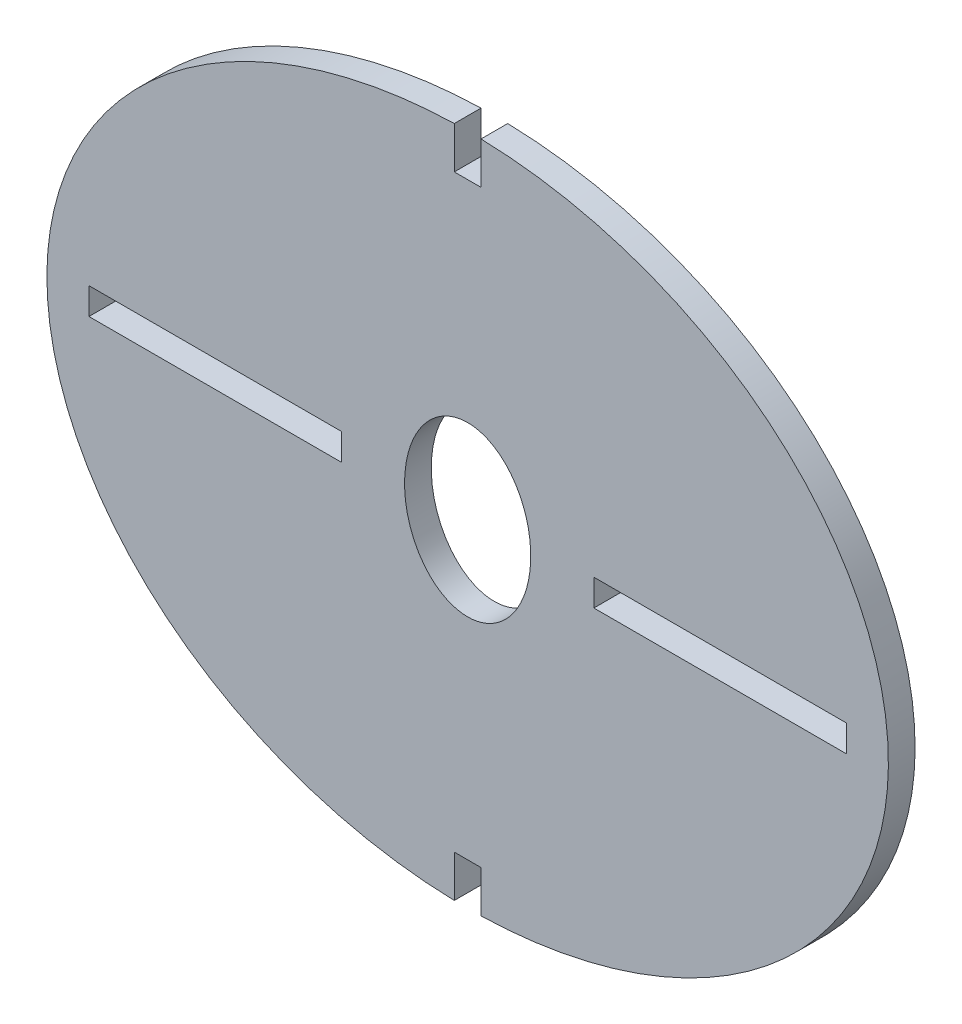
ISO-10303-21;
HEADER;
FILE_DESCRIPTION(('STEP AP214'),'2;1');
FILE_NAME('part.step','',(''),(''),'','','');
FILE_SCHEMA(('AUTOMOTIVE_DESIGN { 1 0 10303 214 1 1 1 1 }'));
ENDSEC;
DATA;
#1=APPLICATION_CONTEXT('core data for automotive mechanical design processes');
#2=APPLICATION_PROTOCOL_DEFINITION('international standard','automotive_design',2000,#1);
#3=PRODUCT_CONTEXT('',#1,'mechanical');
#4=PRODUCT('Part','Part','',(#3));
#5=PRODUCT_RELATED_PRODUCT_CATEGORY('part','',(#4));
#6=PRODUCT_DEFINITION_FORMATION('','',#4);
#7=PRODUCT_DEFINITION_CONTEXT('part definition',#1,'design');
#8=PRODUCT_DEFINITION('design','',#6,#7);
#9=PRODUCT_DEFINITION_SHAPE('','',#8);
#10=(LENGTH_UNIT() NAMED_UNIT(*) SI_UNIT(.MILLI.,.METRE.));
#11=(NAMED_UNIT(*) PLANE_ANGLE_UNIT() SI_UNIT($,.RADIAN.));
#12=(NAMED_UNIT(*) SI_UNIT($,.STERADIAN.) SOLID_ANGLE_UNIT());
#13=UNCERTAINTY_MEASURE_WITH_UNIT(LENGTH_MEASURE(1.E-05),#10,'distance_accuracy_value','');
#14=(GEOMETRIC_REPRESENTATION_CONTEXT(3) GLOBAL_UNCERTAINTY_ASSIGNED_CONTEXT((#13)) GLOBAL_UNIT_ASSIGNED_CONTEXT((#10,
#11,#12)) REPRESENTATION_CONTEXT('',''));
#15=CARTESIAN_POINT('',(0.,0.,0.));
#16=DIRECTION('',(0.,0.,1.));
#17=DIRECTION('',(1.,0.,0.));
#18=AXIS2_PLACEMENT_3D('',#15,#16,#17);
#19=CARTESIAN_POINT('',(0.,0.,3.175));
#20=DIRECTION('',(0.,0.,1.));
#21=DIRECTION('',(-1.,0.,0.));
#22=AXIS2_PLACEMENT_3D('',#19,#20,#21);
#23=ELLIPSE('',#22,50.,40.);
#24=DIRECTION('',(0.,0.,-1.));
#25=VECTOR('',#24,1.);
#26=SURFACE_OF_LINEAR_EXTRUSION('',#23,#25);
#27=CARTESIAN_POINT('',(0.,0.,0.));
#28=DIRECTION('',(0.,0.,1.));
#29=DIRECTION('',(-1.,0.,0.));
#30=AXIS2_PLACEMENT_3D('',#27,#28,#29);
#31=ELLIPSE('',#30,50.,40.);
#32=CARTESIAN_POINT('',(-1.58750000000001,39.9798336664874,0.));
#33=VERTEX_POINT('',#32);
#34=CARTESIAN_POINT('',(-1.58749999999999,-39.9798336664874,0.));
#35=VERTEX_POINT('',#34);
#36=EDGE_CURVE('E285',#33,#35,#31,.T.);
#37=ORIENTED_EDGE('',*,*,#36,.T.);
#38=DIRECTION('',(0.,0.,-1.));
#39=VECTOR('',#38,1.);
#40=CARTESIAN_POINT('',(-1.58749999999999,-39.9798336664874,3.175));
#41=LINE('',#40,#39);
#42=CARTESIAN_POINT('',(-1.58749999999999,-39.9798336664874,3.175));
#43=VERTEX_POINT('',#42);
#44=EDGE_CURVE('E41',#35,#43,#41,.F.);
#45=ORIENTED_EDGE('',*,*,#44,.T.);
#46=CARTESIAN_POINT('',(-1.5875,39.9798336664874,3.175));
#47=VERTEX_POINT('',#46);
#48=EDGE_CURVE('E289',#47,#43,#23,.T.);
#49=ORIENTED_EDGE('',*,*,#48,.F.);
#50=DIRECTION('',(0.,0.,-1.));
#51=VECTOR('',#50,1.);
#52=CARTESIAN_POINT('',(-1.5875,39.9798336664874,3.175));
#53=LINE('',#52,#51);
#54=EDGE_CURVE('E287',#47,#33,#53,.T.);
#55=ORIENTED_EDGE('',*,*,#54,.T.);
#56=EDGE_LOOP('',(#37,#45,#49,#55));
#57=FACE_BOUND('',#56,.T.);
#58=ADVANCED_FACE('F32',(#57),#26,.F.);
#59=CARTESIAN_POINT('',(0.,0.,3.175));
#60=DIRECTION('',(0.,0.,1.));
#61=DIRECTION('',(1.,0.,0.));
#62=AXIS2_PLACEMENT_3D('',#59,#60,#61);
#63=PLANE('',#62);
#64=DIRECTION('',(0.,-1.,0.));
#65=VECTOR('',#64,1.);
#66=CARTESIAN_POINT('',(-1.58749999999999,-35.,3.175));
#67=LINE('',#66,#65);
#68=CARTESIAN_POINT('',(-1.58749999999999,-35.,3.175));
#69=VERTEX_POINT('',#68);
#70=EDGE_CURVE('E160',#69,#43,#67,.T.);
#71=ORIENTED_EDGE('',*,*,#70,.F.);
#72=DIRECTION('',(-1.,0.,0.));
#73=VECTOR('',#72,1.);
#74=CARTESIAN_POINT('',(0.,-35.,3.175));
#75=LINE('',#74,#73);
#76=CARTESIAN_POINT('',(1.58750000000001,-35.,3.175));
#77=VERTEX_POINT('',#76);
#78=EDGE_CURVE('E153',#77,#69,#75,.T.);
#79=ORIENTED_EDGE('',*,*,#78,.F.);
#80=DIRECTION('',(0.,1.,0.));
#81=VECTOR('',#80,1.);
#82=CARTESIAN_POINT('',(1.58750000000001,-61.3968723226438,3.175));
#83=LINE('',#82,#81);
#84=CARTESIAN_POINT('',(1.58750000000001,-39.9798336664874,3.175));
#85=VERTEX_POINT('',#84);
#86=EDGE_CURVE('E157',#85,#77,#83,.T.);
#87=ORIENTED_EDGE('',*,*,#86,.F.);
#88=CARTESIAN_POINT('',(1.58750000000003,39.9798336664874,3.175));
#89=VERTEX_POINT('',#88);
#90=EDGE_CURVE('E56',#85,#89,#23,.T.);
#91=ORIENTED_EDGE('',*,*,#90,.T.);
#92=DIRECTION('',(0.,1.,0.));
#93=VECTOR('',#92,1.);
#94=CARTESIAN_POINT('',(1.5875,61.3968723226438,3.175));
#95=LINE('',#94,#93);
#96=CARTESIAN_POINT('',(1.5875,35.,3.175));
#97=VERTEX_POINT('',#96);
#98=EDGE_CURVE('E173',#97,#89,#95,.T.);
#99=ORIENTED_EDGE('',*,*,#98,.F.);
#100=DIRECTION('',(1.,0.,0.));
#101=VECTOR('',#100,1.);
#102=CARTESIAN_POINT('',(0.,35.,3.175));
#103=LINE('',#102,#101);
#104=CARTESIAN_POINT('',(-1.5875,35.,3.175));
#105=VERTEX_POINT('',#104);
#106=EDGE_CURVE('E178',#105,#97,#103,.T.);
#107=ORIENTED_EDGE('',*,*,#106,.F.);
#108=DIRECTION('',(0.,-1.,0.));
#109=VECTOR('',#108,1.);
#110=CARTESIAN_POINT('',(-1.5875,35.,3.175));
#111=LINE('',#110,#109);
#112=EDGE_CURVE('E175',#47,#105,#111,.T.);
#113=ORIENTED_EDGE('',*,*,#112,.F.);
#114=ORIENTED_EDGE('',*,*,#48,.T.);
#115=EDGE_LOOP('',(#71,#79,#87,#91,#99,#107,#113,#114));
#116=FACE_BOUND('',#115,.T.);
#117=CARTESIAN_POINT('',(0.,0.,3.175));
#118=DIRECTION('',(0.,0.,1.));
#119=DIRECTION('',(0.,-1.,0.));
#120=AXIS2_PLACEMENT_3D('',#117,#118,#119);
#121=ELLIPSE('',#120,10.,7.5);
#122=CARTESIAN_POINT('',(0.,-10.,3.175));
#123=VERTEX_POINT('',#122);
#124=EDGE_CURVE('E254',#123,#123,#121,.T.);
#125=ORIENTED_EDGE('',*,*,#124,.F.);
#126=EDGE_LOOP('',(#125));
#127=FACE_BOUND('',#126,.T.);
#128=DIRECTION('',(1.,0.,0.));
#129=VECTOR('',#128,1.);
#130=CARTESIAN_POINT('',(-45.,-1.58750000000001,3.175));
#131=LINE('',#130,#129);
#132=CARTESIAN_POINT('',(-45.,-1.58750000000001,3.175));
#133=VERTEX_POINT('',#132);
#134=CARTESIAN_POINT('',(-15.,-1.58750000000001,3.175));
#135=VERTEX_POINT('',#134);
#136=EDGE_CURVE('E225',#133,#135,#131,.T.);
#137=ORIENTED_EDGE('',*,*,#136,.F.);
#138=DIRECTION('',(0.,-1.,0.));
#139=VECTOR('',#138,1.);
#140=CARTESIAN_POINT('',(-45.,1.58749999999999,3.175));
#141=LINE('',#140,#139);
#142=CARTESIAN_POINT('',(-45.,1.58749999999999,3.175));
#143=VERTEX_POINT('',#142);
#144=EDGE_CURVE('E223',#143,#133,#141,.T.);
#145=ORIENTED_EDGE('',*,*,#144,.F.);
#146=DIRECTION('',(-1.,0.,0.));
#147=VECTOR('',#146,1.);
#148=CARTESIAN_POINT('',(-15.,1.5875,3.175));
#149=LINE('',#148,#147);
#150=CARTESIAN_POINT('',(-15.,1.5875,3.175));
#151=VERTEX_POINT('',#150);
#152=EDGE_CURVE('E231',#151,#143,#149,.T.);
#153=ORIENTED_EDGE('',*,*,#152,.F.);
#154=DIRECTION('',(0.,1.,0.));
#155=VECTOR('',#154,1.);
#156=CARTESIAN_POINT('',(-15.,1.5875,3.175));
#157=LINE('',#156,#155);
#158=EDGE_CURVE('E228',#135,#151,#157,.T.);
#159=ORIENTED_EDGE('',*,*,#158,.F.);
#160=EDGE_LOOP('',(#137,#145,#153,#159));
#161=FACE_BOUND('',#160,.T.);
#162=DIRECTION('',(0.,-1.,0.));
#163=VECTOR('',#162,1.);
#164=CARTESIAN_POINT('',(15.,1.5875,3.175));
#165=LINE('',#164,#163);
#166=CARTESIAN_POINT('',(15.,1.5875,3.175));
#167=VERTEX_POINT('',#166);
#168=CARTESIAN_POINT('',(15.,-1.5875,3.175));
#169=VERTEX_POINT('',#168);
#170=EDGE_CURVE('E194',#167,#169,#165,.T.);
#171=ORIENTED_EDGE('',*,*,#170,.F.);
#172=DIRECTION('',(-1.,0.,0.));
#173=VECTOR('',#172,1.);
#174=CARTESIAN_POINT('',(15.,1.5875,3.175));
#175=LINE('',#174,#173);
#176=CARTESIAN_POINT('',(45.,1.58750000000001,3.175));
#177=VERTEX_POINT('',#176);
#178=EDGE_CURVE('E192',#177,#167,#175,.T.);
#179=ORIENTED_EDGE('',*,*,#178,.F.);
#180=DIRECTION('',(0.,1.,0.));
#181=VECTOR('',#180,1.);
#182=CARTESIAN_POINT('',(45.,1.58750000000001,3.175));
#183=LINE('',#182,#181);
#184=CARTESIAN_POINT('',(45.,-1.58749999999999,3.175));
#185=VERTEX_POINT('',#184);
#186=EDGE_CURVE('E200',#185,#177,#183,.T.);
#187=ORIENTED_EDGE('',*,*,#186,.F.);
#188=DIRECTION('',(1.,0.,0.));
#189=VECTOR('',#188,1.);
#190=CARTESIAN_POINT('',(45.,-1.58749999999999,3.175));
#191=LINE('',#190,#189);
#192=EDGE_CURVE('E197',#169,#185,#191,.T.);
#193=ORIENTED_EDGE('',*,*,#192,.F.);
#194=EDGE_LOOP('',(#171,#179,#187,#193));
#195=FACE_BOUND('',#194,.T.);
#196=ADVANCED_FACE('F162',(#116,#127,#161,#195),#63,.T.);
#197=CARTESIAN_POINT('',(0.,0.,0.));
#198=DIRECTION('',(0.,0.,1.));
#199=DIRECTION('',(1.,0.,0.));
#200=AXIS2_PLACEMENT_3D('',#197,#198,#199);
#201=PLANE('',#200);
#202=DIRECTION('',(0.,-1.,0.));
#203=VECTOR('',#202,1.);
#204=CARTESIAN_POINT('',(-45.,1.58749999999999,0.));
#205=LINE('',#204,#203);
#206=CARTESIAN_POINT('',(-45.,1.58749999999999,0.));
#207=VERTEX_POINT('',#206);
#208=CARTESIAN_POINT('',(-45.,-1.58750000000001,0.));
#209=VERTEX_POINT('',#208);
#210=EDGE_CURVE('E222',#207,#209,#205,.T.);
#211=ORIENTED_EDGE('',*,*,#210,.T.);
#212=DIRECTION('',(1.,0.,0.));
#213=VECTOR('',#212,1.);
#214=CARTESIAN_POINT('',(-45.,-1.58750000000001,0.));
#215=LINE('',#214,#213);
#216=CARTESIAN_POINT('',(-15.,-1.58750000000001,0.));
#217=VERTEX_POINT('',#216);
#218=EDGE_CURVE('E236',#209,#217,#215,.T.);
#219=ORIENTED_EDGE('',*,*,#218,.T.);
#220=DIRECTION('',(0.,1.,0.));
#221=VECTOR('',#220,1.);
#222=CARTESIAN_POINT('',(-15.,1.5875,0.));
#223=LINE('',#222,#221);
#224=CARTESIAN_POINT('',(-15.,1.5875,0.));
#225=VERTEX_POINT('',#224);
#226=EDGE_CURVE('E239',#217,#225,#223,.T.);
#227=ORIENTED_EDGE('',*,*,#226,.T.);
#228=DIRECTION('',(-1.,0.,0.));
#229=VECTOR('',#228,1.);
#230=CARTESIAN_POINT('',(-15.,1.5875,0.));
#231=LINE('',#230,#229);
#232=EDGE_CURVE('E226',#225,#207,#231,.T.);
#233=ORIENTED_EDGE('',*,*,#232,.T.);
#234=EDGE_LOOP('',(#211,#219,#227,#233));
#235=FACE_BOUND('',#234,.T.);
#236=DIRECTION('',(-1.,0.,0.));
#237=VECTOR('',#236,1.);
#238=CARTESIAN_POINT('',(0.,-35.,0.));
#239=LINE('',#238,#237);
#240=CARTESIAN_POINT('',(1.58750000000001,-35.,0.));
#241=VERTEX_POINT('',#240);
#242=CARTESIAN_POINT('',(-1.58749999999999,-35.,0.));
#243=VERTEX_POINT('',#242);
#244=EDGE_CURVE('E11',#241,#243,#239,.T.);
#245=ORIENTED_EDGE('',*,*,#244,.T.);
#246=DIRECTION('',(0.,-1.,0.));
#247=VECTOR('',#246,1.);
#248=CARTESIAN_POINT('',(-1.5875,0.,0.));
#249=LINE('',#248,#247);
#250=EDGE_CURVE('E170',#243,#35,#249,.T.);
#251=ORIENTED_EDGE('',*,*,#250,.T.);
#252=ORIENTED_EDGE('',*,*,#36,.F.);
#253=DIRECTION('',(0.,-1.,0.));
#254=VECTOR('',#253,1.);
#255=CARTESIAN_POINT('',(-1.5875,0.,0.));
#256=LINE('',#255,#254);
#257=CARTESIAN_POINT('',(-1.5875,35.,0.));
#258=VERTEX_POINT('',#257);
#259=EDGE_CURVE('E188',#33,#258,#256,.T.);
#260=ORIENTED_EDGE('',*,*,#259,.T.);
#261=DIRECTION('',(1.,0.,0.));
#262=VECTOR('',#261,1.);
#263=CARTESIAN_POINT('',(0.,35.,0.));
#264=LINE('',#263,#262);
#265=CARTESIAN_POINT('',(1.5875,35.,0.));
#266=VERTEX_POINT('',#265);
#267=EDGE_CURVE('E296',#258,#266,#264,.T.);
#268=ORIENTED_EDGE('',*,*,#267,.T.);
#269=DIRECTION('',(0.,1.,0.));
#270=VECTOR('',#269,1.);
#271=CARTESIAN_POINT('',(1.5875,0.,0.));
#272=LINE('',#271,#270);
#273=CARTESIAN_POINT('',(1.58750000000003,39.9798336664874,0.));
#274=VERTEX_POINT('',#273);
#275=EDGE_CURVE('E184',#266,#274,#272,.T.);
#276=ORIENTED_EDGE('',*,*,#275,.T.);
#277=CARTESIAN_POINT('',(1.5875,-39.9798336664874,0.));
#278=VERTEX_POINT('',#277);
#279=EDGE_CURVE('E258',#278,#274,#31,.T.);
#280=ORIENTED_EDGE('',*,*,#279,.F.);
#281=DIRECTION('',(0.,1.,0.));
#282=VECTOR('',#281,1.);
#283=CARTESIAN_POINT('',(1.5875,0.,0.));
#284=LINE('',#283,#282);
#285=EDGE_CURVE('E48',#278,#241,#284,.T.);
#286=ORIENTED_EDGE('',*,*,#285,.T.);
#287=EDGE_LOOP('',(#245,#251,#252,#260,#268,#276,#280,#286));
#288=FACE_BOUND('',#287,.T.);
#289=CARTESIAN_POINT('',(0.,0.,0.));
#290=DIRECTION('',(0.,0.,1.));
#291=DIRECTION('',(0.,-1.,0.));
#292=AXIS2_PLACEMENT_3D('',#289,#290,#291);
#293=ELLIPSE('',#292,10.,7.5);
#294=CARTESIAN_POINT('',(0.,-10.,0.));
#295=VERTEX_POINT('',#294);
#296=EDGE_CURVE('E253',#295,#295,#293,.T.);
#297=ORIENTED_EDGE('',*,*,#296,.T.);
#298=EDGE_LOOP('',(#297));
#299=FACE_BOUND('',#298,.T.);
#300=DIRECTION('',(-1.,0.,0.));
#301=VECTOR('',#300,1.);
#302=CARTESIAN_POINT('',(15.,1.5875,0.));
#303=LINE('',#302,#301);
#304=CARTESIAN_POINT('',(45.,1.58750000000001,0.));
#305=VERTEX_POINT('',#304);
#306=CARTESIAN_POINT('',(15.,1.5875,0.));
#307=VERTEX_POINT('',#306);
#308=EDGE_CURVE('E191',#305,#307,#303,.T.);
#309=ORIENTED_EDGE('',*,*,#308,.T.);
#310=DIRECTION('',(0.,-1.,0.));
#311=VECTOR('',#310,1.);
#312=CARTESIAN_POINT('',(15.,1.5875,0.));
#313=LINE('',#312,#311);
#314=CARTESIAN_POINT('',(15.,-1.5875,0.));
#315=VERTEX_POINT('',#314);
#316=EDGE_CURVE('E205',#307,#315,#313,.T.);
#317=ORIENTED_EDGE('',*,*,#316,.T.);
#318=DIRECTION('',(1.,0.,0.));
#319=VECTOR('',#318,1.);
#320=CARTESIAN_POINT('',(45.,-1.58749999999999,0.));
#321=LINE('',#320,#319);
#322=CARTESIAN_POINT('',(45.,-1.58749999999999,0.));
#323=VERTEX_POINT('',#322);
#324=EDGE_CURVE('E208',#315,#323,#321,.T.);
#325=ORIENTED_EDGE('',*,*,#324,.T.);
#326=DIRECTION('',(0.,1.,0.));
#327=VECTOR('',#326,1.);
#328=CARTESIAN_POINT('',(45.,1.58750000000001,0.));
#329=LINE('',#328,#327);
#330=EDGE_CURVE('E195',#323,#305,#329,.T.);
#331=ORIENTED_EDGE('',*,*,#330,.T.);
#332=EDGE_LOOP('',(#309,#317,#325,#331));
#333=FACE_BOUND('',#332,.T.);
#334=ADVANCED_FACE('F268',(#235,#288,#299,#333),#201,.F.);
#335=ORIENTED_EDGE('',*,*,#90,.F.);
#336=DIRECTION('',(0.,0.,-1.));
#337=VECTOR('',#336,1.);
#338=CARTESIAN_POINT('',(1.58750000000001,-39.9798336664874,3.175));
#339=LINE('',#338,#337);
#340=EDGE_CURVE('E159',#85,#278,#339,.T.);
#341=ORIENTED_EDGE('',*,*,#340,.T.);
#342=ORIENTED_EDGE('',*,*,#279,.T.);
#343=DIRECTION('',(0.,0.,-1.));
#344=VECTOR('',#343,1.);
#345=CARTESIAN_POINT('',(1.5875,39.9798336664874,3.175));
#346=LINE('',#345,#344);
#347=EDGE_CURVE('E292',#274,#89,#346,.F.);
#348=ORIENTED_EDGE('',*,*,#347,.T.);
#349=EDGE_LOOP('',(#335,#341,#342,#348));
#350=FACE_BOUND('',#349,.T.);
#351=ADVANCED_FACE('F34',(#350),#26,.F.);
#352=DIRECTION('',(0.,0.,-1.));
#353=VECTOR('',#352,1.);
#354=SURFACE_OF_LINEAR_EXTRUSION('',#121,#353);
#355=ORIENTED_EDGE('',*,*,#124,.T.);
#356=EDGE_LOOP('',(#355));
#357=FACE_BOUND('',#356,.T.);
#358=ORIENTED_EDGE('',*,*,#296,.F.);
#359=EDGE_LOOP('',(#358));
#360=FACE_BOUND('',#359,.T.);
#361=ADVANCED_FACE('F260',(#357,#360),#354,.T.);
#362=CARTESIAN_POINT('',(-45.,1.58749999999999,3.175));
#363=DIRECTION('',(1.,0.,0.));
#364=DIRECTION('',(0.,0.,-1.));
#365=AXIS2_PLACEMENT_3D('',#362,#363,#364);
#366=PLANE('',#365);
#367=ORIENTED_EDGE('',*,*,#210,.F.);
#368=DIRECTION('',(0.,0.,-1.));
#369=VECTOR('',#368,1.);
#370=CARTESIAN_POINT('',(-45.,1.58749999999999,3.175));
#371=LINE('',#370,#369);
#372=EDGE_CURVE('E233',#143,#207,#371,.T.);
#373=ORIENTED_EDGE('',*,*,#372,.F.);
#374=ORIENTED_EDGE('',*,*,#144,.T.);
#375=DIRECTION('',(0.,0.,-1.));
#376=VECTOR('',#375,1.);
#377=CARTESIAN_POINT('',(-45.,-1.58750000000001,3.175));
#378=LINE('',#377,#376);
#379=EDGE_CURVE('E250',#133,#209,#378,.T.);
#380=ORIENTED_EDGE('',*,*,#379,.T.);
#381=EDGE_LOOP('',(#367,#373,#374,#380));
#382=FACE_BOUND('',#381,.T.);
#383=ADVANCED_FACE('F264',(#382),#366,.T.);
#384=CARTESIAN_POINT('',(-45.,-1.58750000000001,3.175));
#385=DIRECTION('',(0.,1.,0.));
#386=DIRECTION('',(0.,0.,1.));
#387=AXIS2_PLACEMENT_3D('',#384,#385,#386);
#388=PLANE('',#387);
#389=ORIENTED_EDGE('',*,*,#218,.F.);
#390=ORIENTED_EDGE('',*,*,#379,.F.);
#391=ORIENTED_EDGE('',*,*,#136,.T.);
#392=DIRECTION('',(0.,0.,-1.));
#393=VECTOR('',#392,1.);
#394=CARTESIAN_POINT('',(-15.,-1.58750000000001,3.175));
#395=LINE('',#394,#393);
#396=EDGE_CURVE('E248',#135,#217,#395,.T.);
#397=ORIENTED_EDGE('',*,*,#396,.T.);
#398=EDGE_LOOP('',(#389,#390,#391,#397));
#399=FACE_BOUND('',#398,.T.);
#400=ADVANCED_FACE('F344',(#399),#388,.T.);
#401=CARTESIAN_POINT('',(-15.,1.5875,3.175));
#402=DIRECTION('',(-1.,0.,0.));
#403=DIRECTION('',(0.,0.,1.));
#404=AXIS2_PLACEMENT_3D('',#401,#402,#403);
#405=PLANE('',#404);
#406=ORIENTED_EDGE('',*,*,#226,.F.);
#407=ORIENTED_EDGE('',*,*,#396,.F.);
#408=ORIENTED_EDGE('',*,*,#158,.T.);
#409=DIRECTION('',(0.,0.,-1.));
#410=VECTOR('',#409,1.);
#411=CARTESIAN_POINT('',(-15.,1.5875,3.175));
#412=LINE('',#411,#410);
#413=EDGE_CURVE('E246',#151,#225,#412,.T.);
#414=ORIENTED_EDGE('',*,*,#413,.T.);
#415=EDGE_LOOP('',(#406,#407,#408,#414));
#416=FACE_BOUND('',#415,.T.);
#417=ADVANCED_FACE('F341',(#416),#405,.T.);
#418=CARTESIAN_POINT('',(-15.,1.5875,3.175));
#419=DIRECTION('',(0.,-1.,0.));
#420=DIRECTION('',(1.,0.,0.));
#421=AXIS2_PLACEMENT_3D('',#418,#419,#420);
#422=PLANE('',#421);
#423=ORIENTED_EDGE('',*,*,#232,.F.);
#424=ORIENTED_EDGE('',*,*,#413,.F.);
#425=ORIENTED_EDGE('',*,*,#152,.T.);
#426=ORIENTED_EDGE('',*,*,#372,.T.);
#427=EDGE_LOOP('',(#423,#424,#425,#426));
#428=FACE_BOUND('',#427,.T.);
#429=ADVANCED_FACE('F337',(#428),#422,.T.);
#430=CARTESIAN_POINT('',(15.,1.5875,3.175));
#431=DIRECTION('',(0.,-1.,0.));
#432=DIRECTION('',(1.,0.,0.));
#433=AXIS2_PLACEMENT_3D('',#430,#431,#432);
#434=PLANE('',#433);
#435=ORIENTED_EDGE('',*,*,#308,.F.);
#436=DIRECTION('',(0.,0.,-1.));
#437=VECTOR('',#436,1.);
#438=CARTESIAN_POINT('',(45.,1.58750000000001,3.175));
#439=LINE('',#438,#437);
#440=EDGE_CURVE('E202',#177,#305,#439,.T.);
#441=ORIENTED_EDGE('',*,*,#440,.F.);
#442=ORIENTED_EDGE('',*,*,#178,.T.);
#443=DIRECTION('',(0.,0.,-1.));
#444=VECTOR('',#443,1.);
#445=CARTESIAN_POINT('',(15.,1.5875,3.175));
#446=LINE('',#445,#444);
#447=EDGE_CURVE('E219',#167,#307,#446,.T.);
#448=ORIENTED_EDGE('',*,*,#447,.T.);
#449=EDGE_LOOP('',(#435,#441,#442,#448));
#450=FACE_BOUND('',#449,.T.);
#451=ADVANCED_FACE('F333',(#450),#434,.T.);
#452=CARTESIAN_POINT('',(15.,1.5875,3.175));
#453=DIRECTION('',(1.,0.,0.));
#454=DIRECTION('',(0.,0.,-1.));
#455=AXIS2_PLACEMENT_3D('',#452,#453,#454);
#456=PLANE('',#455);
#457=ORIENTED_EDGE('',*,*,#316,.F.);
#458=ORIENTED_EDGE('',*,*,#447,.F.);
#459=ORIENTED_EDGE('',*,*,#170,.T.);
#460=DIRECTION('',(0.,0.,-1.));
#461=VECTOR('',#460,1.);
#462=CARTESIAN_POINT('',(15.,-1.5875,3.175));
#463=LINE('',#462,#461);
#464=EDGE_CURVE('E217',#169,#315,#463,.T.);
#465=ORIENTED_EDGE('',*,*,#464,.T.);
#466=EDGE_LOOP('',(#457,#458,#459,#465));
#467=FACE_BOUND('',#466,.T.);
#468=ADVANCED_FACE('F329',(#467),#456,.T.);
#469=CARTESIAN_POINT('',(45.,-1.58749999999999,3.175));
#470=DIRECTION('',(0.,1.,0.));
#471=DIRECTION('',(-1.,0.,0.));
#472=AXIS2_PLACEMENT_3D('',#469,#470,#471);
#473=PLANE('',#472);
#474=ORIENTED_EDGE('',*,*,#324,.F.);
#475=ORIENTED_EDGE('',*,*,#464,.F.);
#476=ORIENTED_EDGE('',*,*,#192,.T.);
#477=DIRECTION('',(0.,0.,-1.));
#478=VECTOR('',#477,1.);
#479=CARTESIAN_POINT('',(45.,-1.58749999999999,3.175));
#480=LINE('',#479,#478);
#481=EDGE_CURVE('E215',#185,#323,#480,.T.);
#482=ORIENTED_EDGE('',*,*,#481,.T.);
#483=EDGE_LOOP('',(#474,#475,#476,#482));
#484=FACE_BOUND('',#483,.T.);
#485=ADVANCED_FACE('F325',(#484),#473,.T.);
#486=CARTESIAN_POINT('',(45.,1.58750000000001,3.175));
#487=DIRECTION('',(-1.,0.,0.));
#488=DIRECTION('',(0.,0.,1.));
#489=AXIS2_PLACEMENT_3D('',#486,#487,#488);
#490=PLANE('',#489);
#491=ORIENTED_EDGE('',*,*,#330,.F.);
#492=ORIENTED_EDGE('',*,*,#481,.F.);
#493=ORIENTED_EDGE('',*,*,#186,.T.);
#494=ORIENTED_EDGE('',*,*,#440,.T.);
#495=EDGE_LOOP('',(#491,#492,#493,#494));
#496=FACE_BOUND('',#495,.T.);
#497=ADVANCED_FACE('F319',(#496),#490,.T.);
#498=CARTESIAN_POINT('',(0.,35.,-6.825));
#499=DIRECTION('',(0.,-1.,0.));
#500=DIRECTION('',(0.,0.,-1.));
#501=AXIS2_PLACEMENT_3D('',#498,#499,#500);
#502=PLANE('',#501);
#503=DIRECTION('',(0.,0.,1.));
#504=VECTOR('',#503,1.);
#505=CARTESIAN_POINT('',(-1.5875,35.,-6.825));
#506=LINE('',#505,#504);
#507=EDGE_CURVE('E182',#258,#105,#506,.T.);
#508=ORIENTED_EDGE('',*,*,#507,.T.);
#509=ORIENTED_EDGE('',*,*,#106,.T.);
#510=DIRECTION('',(0.,0.,1.));
#511=VECTOR('',#510,1.);
#512=CARTESIAN_POINT('',(1.5875,35.,-6.825));
#513=LINE('',#512,#511);
#514=EDGE_CURVE('E181',#266,#97,#513,.T.);
#515=ORIENTED_EDGE('',*,*,#514,.F.);
#516=ORIENTED_EDGE('',*,*,#267,.F.);
#517=EDGE_LOOP('',(#508,#509,#515,#516));
#518=FACE_BOUND('',#517,.T.);
#519=ADVANCED_FACE('F306',(#518),#502,.F.);
#520=CARTESIAN_POINT('',(-1.5875,35.,-6.825));
#521=DIRECTION('',(-1.,0.,0.));
#522=DIRECTION('',(0.,0.,1.));
#523=AXIS2_PLACEMENT_3D('',#520,#521,#522);
#524=PLANE('',#523);
#525=ORIENTED_EDGE('',*,*,#54,.F.);
#526=ORIENTED_EDGE('',*,*,#112,.T.);
#527=ORIENTED_EDGE('',*,*,#507,.F.);
#528=ORIENTED_EDGE('',*,*,#259,.F.);
#529=EDGE_LOOP('',(#525,#526,#527,#528));
#530=FACE_BOUND('',#529,.T.);
#531=ADVANCED_FACE('F311',(#530),#524,.F.);
#532=CARTESIAN_POINT('',(1.5875,61.3968723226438,-6.825));
#533=DIRECTION('',(1.,0.,0.));
#534=DIRECTION('',(0.,1.,0.));
#535=AXIS2_PLACEMENT_3D('',#532,#533,#534);
#536=PLANE('',#535);
#537=ORIENTED_EDGE('',*,*,#514,.T.);
#538=ORIENTED_EDGE('',*,*,#98,.T.);
#539=ORIENTED_EDGE('',*,*,#347,.F.);
#540=ORIENTED_EDGE('',*,*,#275,.F.);
#541=EDGE_LOOP('',(#537,#538,#539,#540));
#542=FACE_BOUND('',#541,.T.);
#543=ADVANCED_FACE('F304',(#542),#536,.F.);
#544=CARTESIAN_POINT('',(0.,-35.,-6.825));
#545=DIRECTION('',(0.,1.,0.));
#546=DIRECTION('',(0.,0.,1.));
#547=AXIS2_PLACEMENT_3D('',#544,#545,#546);
#548=PLANE('',#547);
#549=DIRECTION('',(0.,0.,1.));
#550=VECTOR('',#549,1.);
#551=CARTESIAN_POINT('',(1.58750000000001,-35.,-6.825));
#552=LINE('',#551,#550);
#553=EDGE_CURVE('E148',#241,#77,#552,.T.);
#554=ORIENTED_EDGE('',*,*,#553,.T.);
#555=ORIENTED_EDGE('',*,*,#78,.T.);
#556=DIRECTION('',(0.,0.,1.));
#557=VECTOR('',#556,1.);
#558=CARTESIAN_POINT('',(-1.58749999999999,-35.,-6.825));
#559=LINE('',#558,#557);
#560=EDGE_CURVE('E155',#243,#69,#559,.T.);
#561=ORIENTED_EDGE('',*,*,#560,.F.);
#562=ORIENTED_EDGE('',*,*,#244,.F.);
#563=EDGE_LOOP('',(#554,#555,#561,#562));
#564=FACE_BOUND('',#563,.T.);
#565=ADVANCED_FACE('F150',(#564),#548,.F.);
#566=CARTESIAN_POINT('',(-1.58749999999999,-35.,-6.825));
#567=DIRECTION('',(-1.,0.,0.));
#568=DIRECTION('',(0.,-1.,0.));
#569=AXIS2_PLACEMENT_3D('',#566,#567,#568);
#570=PLANE('',#569);
#571=ORIENTED_EDGE('',*,*,#560,.T.);
#572=ORIENTED_EDGE('',*,*,#70,.T.);
#573=ORIENTED_EDGE('',*,*,#44,.F.);
#574=ORIENTED_EDGE('',*,*,#250,.F.);
#575=EDGE_LOOP('',(#571,#572,#573,#574));
#576=FACE_BOUND('',#575,.T.);
#577=ADVANCED_FACE('F421',(#576),#570,.F.);
#578=CARTESIAN_POINT('',(1.58750000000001,-61.3968723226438,-6.825));
#579=DIRECTION('',(1.,0.,0.));
#580=DIRECTION('',(0.,1.,0.));
#581=AXIS2_PLACEMENT_3D('',#578,#579,#580);
#582=PLANE('',#581);
#583=ORIENTED_EDGE('',*,*,#340,.F.);
#584=ORIENTED_EDGE('',*,*,#86,.T.);
#585=ORIENTED_EDGE('',*,*,#553,.F.);
#586=ORIENTED_EDGE('',*,*,#285,.F.);
#587=EDGE_LOOP('',(#583,#584,#585,#586));
#588=FACE_BOUND('',#587,.T.);
#589=ADVANCED_FACE('F158',(#588),#582,.F.);
#590=CLOSED_SHELL('',(#58,#196,#334,#351,#361,#383,#400,#417,#429,#451,#468,#485,#497,#519,#531,
#543,#565,#577,#589));
#591=MANIFOLD_SOLID_BREP('B2',#590);
#592=ADVANCED_BREP_SHAPE_REPRESENTATION('',(#18,#591),#14);
#593=SHAPE_DEFINITION_REPRESENTATION(#9,#592);
ENDSEC;
END-ISO-10303-21;
